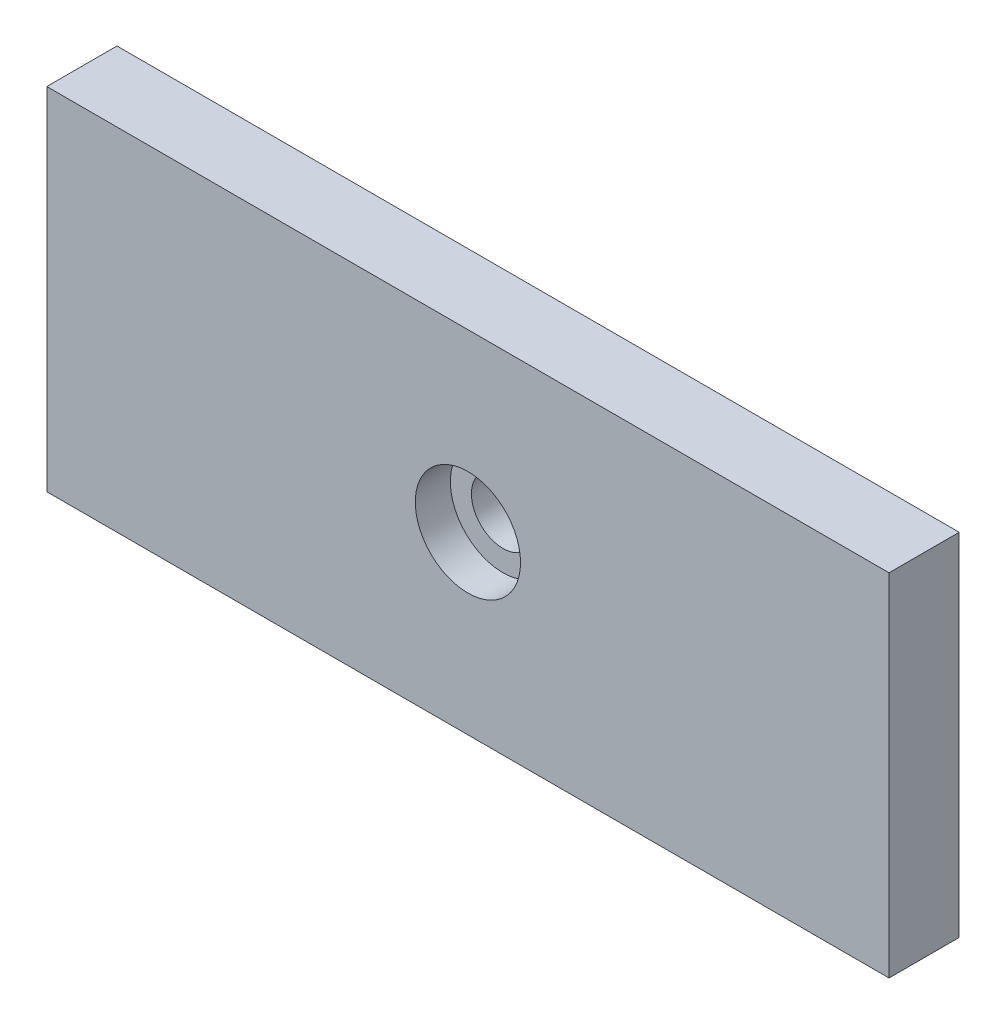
ISO-10303-21;
HEADER;
FILE_DESCRIPTION(('STEP AP214'),'2;1');
FILE_NAME('part.step','',(''),(''),'','','');
FILE_SCHEMA(('AUTOMOTIVE_DESIGN { 1 0 10303 214 1 1 1 1 }'));
ENDSEC;
DATA;
#1=APPLICATION_CONTEXT('core data for automotive mechanical design processes');
#2=APPLICATION_PROTOCOL_DEFINITION('international standard','automotive_design',2000,#1);
#3=PRODUCT_CONTEXT('',#1,'mechanical');
#4=PRODUCT('Part','Part','',(#3));
#5=PRODUCT_RELATED_PRODUCT_CATEGORY('part','',(#4));
#6=PRODUCT_DEFINITION_FORMATION('','',#4);
#7=PRODUCT_DEFINITION_CONTEXT('part definition',#1,'design');
#8=PRODUCT_DEFINITION('design','',#6,#7);
#9=PRODUCT_DEFINITION_SHAPE('','',#8);
#10=(LENGTH_UNIT() NAMED_UNIT(*) SI_UNIT(.MILLI.,.METRE.));
#11=(NAMED_UNIT(*) PLANE_ANGLE_UNIT() SI_UNIT($,.RADIAN.));
#12=(NAMED_UNIT(*) SI_UNIT($,.STERADIAN.) SOLID_ANGLE_UNIT());
#13=UNCERTAINTY_MEASURE_WITH_UNIT(LENGTH_MEASURE(1.E-05),#10,'distance_accuracy_value','');
#14=(GEOMETRIC_REPRESENTATION_CONTEXT(3) GLOBAL_UNCERTAINTY_ASSIGNED_CONTEXT((#13)) GLOBAL_UNIT_ASSIGNED_CONTEXT((#10,
#11,#12)) REPRESENTATION_CONTEXT('',''));
#15=CARTESIAN_POINT('',(0.,0.,0.));
#16=DIRECTION('',(0.,0.,1.));
#17=DIRECTION('',(1.,0.,0.));
#18=AXIS2_PLACEMENT_3D('',#15,#16,#17);
#19=CARTESIAN_POINT('',(-1616.55584509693,-1025.,10.));
#20=DIRECTION('',(1.,0.,0.));
#21=DIRECTION('',(0.,0.,-1.));
#22=AXIS2_PLACEMENT_3D('',#19,#20,#21);
#23=PLANE('',#22);
#24=DIRECTION('',(0.,-1.,0.));
#25=VECTOR('',#24,1.);
#26=CARTESIAN_POINT('',(-1616.55584509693,-1025.,0.));
#27=LINE('',#26,#25);
#28=CARTESIAN_POINT('',(-1616.55584509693,-975.,0.));
#29=VERTEX_POINT('',#28);
#30=CARTESIAN_POINT('',(-1616.55584509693,-1025.,0.));
#31=VERTEX_POINT('',#30);
#32=EDGE_CURVE('E68',#29,#31,#27,.T.);
#33=ORIENTED_EDGE('',*,*,#32,.T.);
#34=DIRECTION('',(0.,0.,-1.));
#35=VECTOR('',#34,1.);
#36=CARTESIAN_POINT('',(-1616.55584509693,-1025.,10.));
#37=LINE('',#36,#35);
#38=CARTESIAN_POINT('',(-1616.55584509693,-1025.,10.));
#39=VERTEX_POINT('',#38);
#40=EDGE_CURVE('E11',#39,#31,#37,.T.);
#41=ORIENTED_EDGE('',*,*,#40,.F.);
#42=DIRECTION('',(0.,-1.,0.));
#43=VECTOR('',#42,1.);
#44=CARTESIAN_POINT('',(-1616.55584509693,-1025.,10.));
#45=LINE('',#44,#43);
#46=CARTESIAN_POINT('',(-1616.55584509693,-975.,10.));
#47=VERTEX_POINT('',#46);
#48=EDGE_CURVE('E91',#47,#39,#45,.T.);
#49=ORIENTED_EDGE('',*,*,#48,.F.);
#50=DIRECTION('',(0.,0.,-1.));
#51=VECTOR('',#50,1.);
#52=CARTESIAN_POINT('',(-1616.55584509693,-975.,10.));
#53=LINE('',#52,#51);
#54=EDGE_CURVE('E80',#47,#29,#53,.T.);
#55=ORIENTED_EDGE('',*,*,#54,.T.);
#56=EDGE_LOOP('',(#33,#41,#49,#55));
#57=FACE_BOUND('',#56,.T.);
#58=ADVANCED_FACE('F24',(#57),#23,.F.);
#59=CARTESIAN_POINT('',(-1616.55584509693,-1025.,10.));
#60=DIRECTION('',(0.,1.,0.));
#61=DIRECTION('',(-1.,0.,0.));
#62=AXIS2_PLACEMENT_3D('',#59,#60,#61);
#63=PLANE('',#62);
#64=DIRECTION('',(1.,0.,0.));
#65=VECTOR('',#64,1.);
#66=CARTESIAN_POINT('',(-1616.55584509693,-1025.,0.));
#67=LINE('',#66,#65);
#68=CARTESIAN_POINT('',(-1496.55584509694,-1025.,0.));
#69=VERTEX_POINT('',#68);
#70=EDGE_CURVE('E64',#31,#69,#67,.T.);
#71=ORIENTED_EDGE('',*,*,#70,.T.);
#72=DIRECTION('',(0.,0.,-1.));
#73=VECTOR('',#72,1.);
#74=CARTESIAN_POINT('',(-1496.55584509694,-1025.,10.));
#75=LINE('',#74,#73);
#76=CARTESIAN_POINT('',(-1496.55584509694,-1025.,10.));
#77=VERTEX_POINT('',#76);
#78=EDGE_CURVE('E31',#77,#69,#75,.T.);
#79=ORIENTED_EDGE('',*,*,#78,.F.);
#80=DIRECTION('',(1.,0.,0.));
#81=VECTOR('',#80,1.);
#82=CARTESIAN_POINT('',(-1616.55584509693,-1025.,10.));
#83=LINE('',#82,#81);
#84=EDGE_CURVE('E76',#39,#77,#83,.T.);
#85=ORIENTED_EDGE('',*,*,#84,.F.);
#86=ORIENTED_EDGE('',*,*,#40,.T.);
#87=EDGE_LOOP('',(#71,#79,#85,#86));
#88=FACE_BOUND('',#87,.T.);
#89=ADVANCED_FACE('F75',(#88),#63,.F.);
#90=CARTESIAN_POINT('',(-1496.55584509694,-1025.,10.));
#91=DIRECTION('',(-1.,0.,0.));
#92=DIRECTION('',(0.,0.,1.));
#93=AXIS2_PLACEMENT_3D('',#90,#91,#92);
#94=PLANE('',#93);
#95=DIRECTION('',(0.,1.,0.));
#96=VECTOR('',#95,1.);
#97=CARTESIAN_POINT('',(-1496.55584509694,-1025.,0.));
#98=LINE('',#97,#96);
#99=CARTESIAN_POINT('',(-1496.55584509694,-975.,0.));
#100=VERTEX_POINT('',#99);
#101=EDGE_CURVE('E69',#69,#100,#98,.T.);
#102=ORIENTED_EDGE('',*,*,#101,.T.);
#103=DIRECTION('',(0.,0.,-1.));
#104=VECTOR('',#103,1.);
#105=CARTESIAN_POINT('',(-1496.55584509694,-975.,10.));
#106=LINE('',#105,#104);
#107=CARTESIAN_POINT('',(-1496.55584509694,-975.,10.));
#108=VERTEX_POINT('',#107);
#109=EDGE_CURVE('E97',#108,#100,#106,.T.);
#110=ORIENTED_EDGE('',*,*,#109,.F.);
#111=DIRECTION('',(0.,1.,0.));
#112=VECTOR('',#111,1.);
#113=CARTESIAN_POINT('',(-1496.55584509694,-1025.,10.));
#114=LINE('',#113,#112);
#115=EDGE_CURVE('E43',#77,#108,#114,.T.);
#116=ORIENTED_EDGE('',*,*,#115,.F.);
#117=ORIENTED_EDGE('',*,*,#78,.T.);
#118=EDGE_LOOP('',(#102,#110,#116,#117));
#119=FACE_BOUND('',#118,.T.);
#120=ADVANCED_FACE('F100',(#119),#94,.F.);
#121=CARTESIAN_POINT('',(-1496.55584509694,-975.,10.));
#122=DIRECTION('',(0.,-1.,0.));
#123=DIRECTION('',(0.,0.,-1.));
#124=AXIS2_PLACEMENT_3D('',#121,#122,#123);
#125=PLANE('',#124);
#126=DIRECTION('',(-1.,0.,0.));
#127=VECTOR('',#126,1.);
#128=CARTESIAN_POINT('',(-1496.55584509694,-975.,0.));
#129=LINE('',#128,#127);
#130=EDGE_CURVE('E89',#100,#29,#129,.T.);
#131=ORIENTED_EDGE('',*,*,#130,.T.);
#132=ORIENTED_EDGE('',*,*,#54,.F.);
#133=DIRECTION('',(-1.,0.,0.));
#134=VECTOR('',#133,1.);
#135=CARTESIAN_POINT('',(-1496.55584509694,-975.,10.));
#136=LINE('',#135,#134);
#137=EDGE_CURVE('E38',#108,#47,#136,.T.);
#138=ORIENTED_EDGE('',*,*,#137,.F.);
#139=ORIENTED_EDGE('',*,*,#109,.T.);
#140=EDGE_LOOP('',(#131,#132,#138,#139));
#141=FACE_BOUND('',#140,.T.);
#142=ADVANCED_FACE('F102',(#141),#125,.F.);
#143=CARTESIAN_POINT('',(-1616.55584509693,-975.,10.));
#144=DIRECTION('',(0.,0.,1.));
#145=DIRECTION('',(1.,0.,0.));
#146=AXIS2_PLACEMENT_3D('',#143,#144,#145);
#147=PLANE('',#146);
#148=CARTESIAN_POINT('',(-1556.55584726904,-1000.00000000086,9.9999999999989));
#149=DIRECTION('',(0.,0.,1.));
#150=DIRECTION('',(1.,0.,0.));
#151=AXIS2_PLACEMENT_3D('',#148,#149,#150);
#152=CIRCLE('',#151,7.50000000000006);
#153=CARTESIAN_POINT('',(-1549.05584726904,-1000.00000000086,9.9999999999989));
#154=VERTEX_POINT('',#153);
#155=EDGE_CURVE('E81',#154,#154,#152,.T.);
#156=ORIENTED_EDGE('',*,*,#155,.F.);
#157=EDGE_LOOP('',(#156));
#158=FACE_BOUND('',#157,.T.);
#159=ORIENTED_EDGE('',*,*,#48,.T.);
#160=ORIENTED_EDGE('',*,*,#84,.T.);
#161=ORIENTED_EDGE('',*,*,#115,.T.);
#162=ORIENTED_EDGE('',*,*,#137,.T.);
#163=EDGE_LOOP('',(#159,#160,#161,#162));
#164=FACE_BOUND('',#163,.T.);
#165=ADVANCED_FACE('F103',(#158,#164),#147,.T.);
#166=CARTESIAN_POINT('',(-1616.55584509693,-975.,0.));
#167=DIRECTION('',(0.,0.,1.));
#168=DIRECTION('',(1.,0.,0.));
#169=AXIS2_PLACEMENT_3D('',#166,#167,#168);
#170=PLANE('',#169);
#171=CARTESIAN_POINT('',(-1556.55584726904,-1000.00000000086,-1.09807996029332E-12));
#172=DIRECTION('',(0.,0.,1.));
#173=DIRECTION('',(1.,0.,0.));
#174=AXIS2_PLACEMENT_3D('',#171,#172,#173);
#175=CIRCLE('',#174,4.49999999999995);
#176=CARTESIAN_POINT('',(-1552.05584726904,-1000.00000000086,-1.09807996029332E-12));
#177=VERTEX_POINT('',#176);
#178=EDGE_CURVE('E164',#177,#177,#175,.T.);
#179=ORIENTED_EDGE('',*,*,#178,.T.);
#180=EDGE_LOOP('',(#179));
#181=FACE_BOUND('',#180,.T.);
#182=ORIENTED_EDGE('',*,*,#32,.F.);
#183=ORIENTED_EDGE('',*,*,#130,.F.);
#184=ORIENTED_EDGE('',*,*,#101,.F.);
#185=ORIENTED_EDGE('',*,*,#70,.F.);
#186=EDGE_LOOP('',(#182,#183,#184,#185));
#187=FACE_BOUND('',#186,.T.);
#188=ADVANCED_FACE('F65',(#181,#187),#170,.F.);
#189=CARTESIAN_POINT('',(-1556.55584726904,-1000.00000000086,9.9999999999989));
#190=DIRECTION('',(0.,0.,1.));
#191=DIRECTION('',(1.,0.,0.));
#192=AXIS2_PLACEMENT_3D('',#189,#190,#191);
#193=CYLINDRICAL_SURFACE('',#192,7.50000000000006);
#194=CARTESIAN_POINT('',(-1556.55584726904,-1000.00000000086,4.9999999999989));
#195=DIRECTION('',(0.,0.,1.));
#196=DIRECTION('',(1.,0.,0.));
#197=AXIS2_PLACEMENT_3D('',#194,#195,#196);
#198=CIRCLE('',#197,7.50000000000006);
#199=CARTESIAN_POINT('',(-1549.05584726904,-1000.00000000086,4.9999999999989));
#200=VERTEX_POINT('',#199);
#201=EDGE_CURVE('E84',#200,#200,#198,.T.);
#202=ORIENTED_EDGE('',*,*,#201,.F.);
#203=EDGE_LOOP('',(#202));
#204=FACE_BOUND('',#203,.T.);
#205=ORIENTED_EDGE('',*,*,#155,.T.);
#206=EDGE_LOOP('',(#205));
#207=FACE_BOUND('',#206,.T.);
#208=ADVANCED_FACE('F111',(#204,#207),#193,.F.);
#209=CARTESIAN_POINT('',(-1552.05584726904,-1000.00000000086,4.9999999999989));
#210=DIRECTION('',(0.,0.,-1.));
#211=DIRECTION('',(-1.,0.,0.));
#212=AXIS2_PLACEMENT_3D('',#209,#210,#211);
#213=PLANE('',#212);
#214=CARTESIAN_POINT('',(-1556.55584726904,-1000.00000000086,4.9999999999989));
#215=DIRECTION('',(0.,0.,1.));
#216=DIRECTION('',(1.,0.,0.));
#217=AXIS2_PLACEMENT_3D('',#214,#215,#216);
#218=CIRCLE('',#217,4.49999999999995);
#219=CARTESIAN_POINT('',(-1552.05584726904,-1000.00000000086,4.9999999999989));
#220=VERTEX_POINT('',#219);
#221=EDGE_CURVE('E167',#220,#220,#218,.T.);
#222=ORIENTED_EDGE('',*,*,#221,.F.);
#223=EDGE_LOOP('',(#222));
#224=FACE_BOUND('',#223,.T.);
#225=ORIENTED_EDGE('',*,*,#201,.T.);
#226=EDGE_LOOP('',(#225));
#227=FACE_BOUND('',#226,.T.);
#228=ADVANCED_FACE('F143',(#224,#227),#213,.F.);
#229=CARTESIAN_POINT('',(-1556.55584726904,-1000.00000000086,9.9999999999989));
#230=DIRECTION('',(0.,0.,1.));
#231=DIRECTION('',(1.,0.,0.));
#232=AXIS2_PLACEMENT_3D('',#229,#230,#231);
#233=CYLINDRICAL_SURFACE('',#232,4.49999999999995);
#234=ORIENTED_EDGE('',*,*,#178,.F.);
#235=EDGE_LOOP('',(#234));
#236=FACE_BOUND('',#235,.T.);
#237=ORIENTED_EDGE('',*,*,#221,.T.);
#238=EDGE_LOOP('',(#237));
#239=FACE_BOUND('',#238,.T.);
#240=ADVANCED_FACE('F151',(#236,#239),#233,.F.);
#241=CLOSED_SHELL('',(#58,#89,#120,#142,#165,#188,#208,#228,#240));
#242=MANIFOLD_SOLID_BREP('B2',#241);
#243=ADVANCED_BREP_SHAPE_REPRESENTATION('',(#18,#242),#14);
#244=SHAPE_DEFINITION_REPRESENTATION(#9,#243);
ENDSEC;
END-ISO-10303-21;
